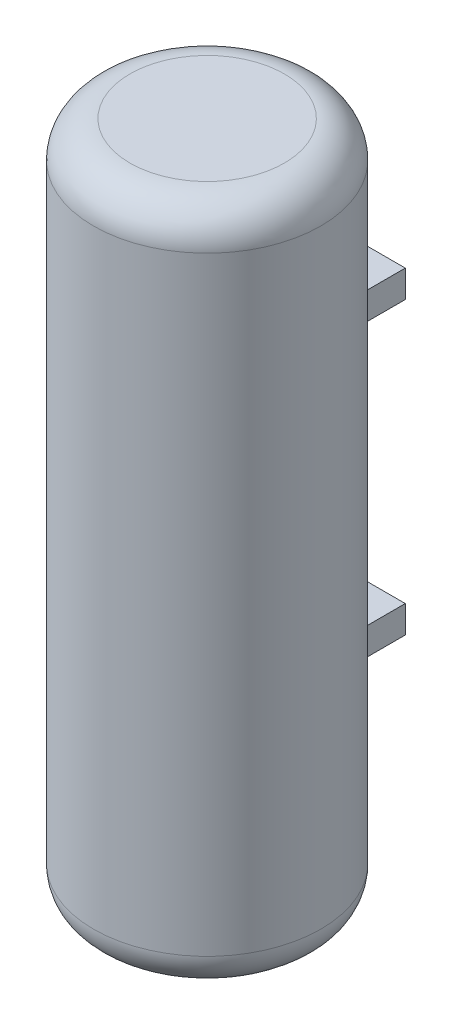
ISO-10303-21;
HEADER;
FILE_DESCRIPTION(('STEP AP214'),'2;1');
FILE_NAME('part.step','',(''),(''),'','','');
FILE_SCHEMA(('AUTOMOTIVE_DESIGN { 1 0 10303 214 1 1 1 1 }'));
ENDSEC;
DATA;
#1=APPLICATION_CONTEXT('core data for automotive mechanical design processes');
#2=APPLICATION_PROTOCOL_DEFINITION('international standard','automotive_design',2000,#1);
#3=PRODUCT_CONTEXT('',#1,'mechanical');
#4=PRODUCT('Part','Part','',(#3));
#5=PRODUCT_RELATED_PRODUCT_CATEGORY('part','',(#4));
#6=PRODUCT_DEFINITION_FORMATION('','',#4);
#7=PRODUCT_DEFINITION_CONTEXT('part definition',#1,'design');
#8=PRODUCT_DEFINITION('design','',#6,#7);
#9=PRODUCT_DEFINITION_SHAPE('','',#8);
#10=(LENGTH_UNIT() NAMED_UNIT(*) SI_UNIT(.MILLI.,.METRE.));
#11=(NAMED_UNIT(*) PLANE_ANGLE_UNIT() SI_UNIT($,.RADIAN.));
#12=(NAMED_UNIT(*) SI_UNIT($,.STERADIAN.) SOLID_ANGLE_UNIT());
#13=UNCERTAINTY_MEASURE_WITH_UNIT(LENGTH_MEASURE(1.E-05),#10,'distance_accuracy_value','');
#14=(GEOMETRIC_REPRESENTATION_CONTEXT(3) GLOBAL_UNCERTAINTY_ASSIGNED_CONTEXT((#13)) GLOBAL_UNIT_ASSIGNED_CONTEXT((#10,
#11,#12)) REPRESENTATION_CONTEXT('',''));
#15=CARTESIAN_POINT('',(0.,0.,0.));
#16=DIRECTION('',(0.,0.,1.));
#17=DIRECTION('',(1.,0.,0.));
#18=AXIS2_PLACEMENT_3D('',#15,#16,#17);
#19=CARTESIAN_POINT('',(0.,1500.,0.));
#20=DIRECTION('',(0.,-1.,0.));
#21=DIRECTION('',(0.,0.,-1.));
#22=AXIS2_PLACEMENT_3D('',#19,#20,#21);
#23=CYLINDRICAL_SURFACE('',#22,250.);
#24=CARTESIAN_POINT('',(0.,507.631468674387,0.));
#25=DIRECTION('',(0.,1.,0.));
#26=DIRECTION('',(0.,0.,1.));
#27=AXIS2_PLACEMENT_3D('',#24,#25,#26);
#28=CIRCLE('',#27,250.);
#29=CARTESIAN_POINT('',(150.,507.631468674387,-200.));
#30=VERTEX_POINT('',#29);
#31=CARTESIAN_POINT('',(-150.,507.631468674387,-200.));
#32=VERTEX_POINT('',#31);
#33=EDGE_CURVE('E41',#30,#32,#28,.T.);
#34=ORIENTED_EDGE('',*,*,#33,.T.);
#35=DIRECTION('',(0.,-1.,0.));
#36=VECTOR('',#35,1.);
#37=CARTESIAN_POINT('',(-150.,1500.,-200.));
#38=LINE('',#37,#36);
#39=CARTESIAN_POINT('',(-150.,447.631468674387,-200.));
#40=VERTEX_POINT('',#39);
#41=EDGE_CURVE('E11',#32,#40,#38,.T.);
#42=ORIENTED_EDGE('',*,*,#41,.T.);
#43=CARTESIAN_POINT('',(0.,447.631468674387,0.));
#44=DIRECTION('',(0.,-1.,0.));
#45=DIRECTION('',(0.,0.,-1.));
#46=AXIS2_PLACEMENT_3D('',#43,#44,#45);
#47=CIRCLE('',#46,250.);
#48=CARTESIAN_POINT('',(150.,447.631468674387,-200.));
#49=VERTEX_POINT('',#48);
#50=EDGE_CURVE('E101',#40,#49,#47,.T.);
#51=ORIENTED_EDGE('',*,*,#50,.T.);
#52=DIRECTION('',(0.,-1.,0.));
#53=VECTOR('',#52,1.);
#54=CARTESIAN_POINT('',(149.999999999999,1500.,-200.));
#55=LINE('',#54,#53);
#56=EDGE_CURVE('E183',#49,#30,#55,.F.);
#57=ORIENTED_EDGE('',*,*,#56,.T.);
#58=EDGE_LOOP('',(#34,#42,#51,#57));
#59=FACE_BOUND('',#58,.T.);
#60=CARTESIAN_POINT('',(0.,1146.93707662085,0.));
#61=DIRECTION('',(0.,1.,0.));
#62=DIRECTION('',(0.,0.,1.));
#63=AXIS2_PLACEMENT_3D('',#60,#61,#62);
#64=CIRCLE('',#63,250.);
#65=CARTESIAN_POINT('',(150.,1146.93707662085,-200.));
#66=VERTEX_POINT('',#65);
#67=CARTESIAN_POINT('',(-150.,1146.93707662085,-200.));
#68=VERTEX_POINT('',#67);
#69=EDGE_CURVE('E176',#66,#68,#64,.T.);
#70=ORIENTED_EDGE('',*,*,#69,.T.);
#71=DIRECTION('',(0.,-1.,0.));
#72=VECTOR('',#71,1.);
#73=CARTESIAN_POINT('',(-150.,1500.,-200.));
#74=LINE('',#73,#72);
#75=CARTESIAN_POINT('',(-150.,1086.93707662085,-200.));
#76=VERTEX_POINT('',#75);
#77=EDGE_CURVE('E179',#68,#76,#74,.T.);
#78=ORIENTED_EDGE('',*,*,#77,.T.);
#79=CARTESIAN_POINT('',(0.,1086.93707662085,0.));
#80=DIRECTION('',(0.,-1.,0.));
#81=DIRECTION('',(0.,0.,-1.));
#82=AXIS2_PLACEMENT_3D('',#79,#80,#81);
#83=CIRCLE('',#82,250.);
#84=CARTESIAN_POINT('',(150.,1086.93707662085,-200.));
#85=VERTEX_POINT('',#84);
#86=EDGE_CURVE('E170',#76,#85,#83,.T.);
#87=ORIENTED_EDGE('',*,*,#86,.T.);
#88=DIRECTION('',(0.,-1.,0.));
#89=VECTOR('',#88,1.);
#90=CARTESIAN_POINT('',(150.,1500.,-200.));
#91=LINE('',#90,#89);
#92=EDGE_CURVE('E173',#85,#66,#91,.F.);
#93=ORIENTED_EDGE('',*,*,#92,.T.);
#94=EDGE_LOOP('',(#70,#78,#87,#93));
#95=FACE_BOUND('',#94,.T.);
#96=CARTESIAN_POINT('',(0.,80.0000000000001,0.));
#97=DIRECTION('',(0.,1.,0.));
#98=DIRECTION('',(0.,0.,1.));
#99=AXIS2_PLACEMENT_3D('',#96,#97,#98);
#100=CIRCLE('',#99,250.);
#101=CARTESIAN_POINT('',(0.,80.0000000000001,250.));
#102=VERTEX_POINT('',#101);
#103=EDGE_CURVE('E152',#102,#102,#100,.T.);
#104=ORIENTED_EDGE('',*,*,#103,.T.);
#105=EDGE_LOOP('',(#104));
#106=FACE_BOUND('',#105,.T.);
#107=CARTESIAN_POINT('',(0.,1420.,0.));
#108=DIRECTION('',(0.,1.,0.));
#109=DIRECTION('',(0.,0.,1.));
#110=AXIS2_PLACEMENT_3D('',#107,#108,#109);
#111=CIRCLE('',#110,250.);
#112=CARTESIAN_POINT('',(0.,1420.,250.));
#113=VERTEX_POINT('',#112);
#114=EDGE_CURVE('E143',#113,#113,#111,.F.);
#115=ORIENTED_EDGE('',*,*,#114,.T.);
#116=EDGE_LOOP('',(#115));
#117=FACE_BOUND('',#116,.T.);
#118=ADVANCED_FACE('F33',(#59,#95,#106,#117),#23,.T.);
#119=CARTESIAN_POINT('',(0.,1500.,0.));
#120=DIRECTION('',(0.,1.,0.));
#121=DIRECTION('',(0.,0.,1.));
#122=AXIS2_PLACEMENT_3D('',#119,#120,#121);
#123=PLANE('',#122);
#124=CARTESIAN_POINT('',(0.,1500.,0.));
#125=DIRECTION('',(0.,1.,0.));
#126=DIRECTION('',(0.,0.,1.));
#127=AXIS2_PLACEMENT_3D('',#124,#125,#126);
#128=CIRCLE('',#127,170.);
#129=CARTESIAN_POINT('',(0.,1500.,170.));
#130=VERTEX_POINT('',#129);
#131=EDGE_CURVE('E158',#130,#130,#128,.T.);
#132=ORIENTED_EDGE('',*,*,#131,.T.);
#133=EDGE_LOOP('',(#132));
#134=FACE_BOUND('',#133,.T.);
#135=ADVANCED_FACE('F203',(#134),#123,.T.);
#136=CARTESIAN_POINT('',(0.,0.,0.));
#137=DIRECTION('',(0.,1.,0.));
#138=DIRECTION('',(0.,0.,1.));
#139=AXIS2_PLACEMENT_3D('',#136,#137,#138);
#140=PLANE('',#139);
#141=CARTESIAN_POINT('',(0.,0.,0.));
#142=DIRECTION('',(0.,1.,0.));
#143=DIRECTION('',(0.,0.,1.));
#144=AXIS2_PLACEMENT_3D('',#141,#142,#143);
#145=CIRCLE('',#144,75.);
#146=CARTESIAN_POINT('',(0.,0.,75.));
#147=VERTEX_POINT('',#146);
#148=EDGE_CURVE('E161',#147,#147,#145,.F.);
#149=ORIENTED_EDGE('',*,*,#148,.F.);
#150=EDGE_LOOP('',(#149));
#151=FACE_BOUND('',#150,.T.);
#152=CARTESIAN_POINT('',(0.,0.,0.));
#153=DIRECTION('',(0.,1.,0.));
#154=DIRECTION('',(0.,0.,1.));
#155=AXIS2_PLACEMENT_3D('',#152,#153,#154);
#156=CIRCLE('',#155,170.);
#157=CARTESIAN_POINT('',(0.,0.,170.));
#158=VERTEX_POINT('',#157);
#159=EDGE_CURVE('E155',#158,#158,#156,.F.);
#160=ORIENTED_EDGE('',*,*,#159,.T.);
#161=EDGE_LOOP('',(#160));
#162=FACE_BOUND('',#161,.T.);
#163=ADVANCED_FACE('F208',(#151,#162),#140,.F.);
#164=CARTESIAN_POINT('',(0.,80.0000000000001,0.));
#165=DIRECTION('',(0.,1.,0.));
#166=DIRECTION('',(0.,0.,1.));
#167=AXIS2_PLACEMENT_3D('',#164,#165,#166);
#168=TOROIDAL_SURFACE('',#167,170.,80.);
#169=ORIENTED_EDGE('',*,*,#159,.F.);
#170=EDGE_LOOP('',(#169));
#171=FACE_BOUND('',#170,.T.);
#172=ORIENTED_EDGE('',*,*,#103,.F.);
#173=EDGE_LOOP('',(#172));
#174=FACE_BOUND('',#173,.T.);
#175=ADVANCED_FACE('F213',(#171,#174),#168,.T.);
#176=CARTESIAN_POINT('',(0.,1420.,0.));
#177=DIRECTION('',(0.,1.,0.));
#178=DIRECTION('',(0.,0.,1.));
#179=AXIS2_PLACEMENT_3D('',#176,#177,#178);
#180=TOROIDAL_SURFACE('',#179,170.,80.);
#181=ORIENTED_EDGE('',*,*,#114,.F.);
#182=EDGE_LOOP('',(#181));
#183=FACE_BOUND('',#182,.T.);
#184=ORIENTED_EDGE('',*,*,#131,.F.);
#185=EDGE_LOOP('',(#184));
#186=FACE_BOUND('',#185,.T.);
#187=ADVANCED_FACE('F215',(#183,#186),#180,.T.);
#188=CARTESIAN_POINT('',(0.,-60.,0.));
#189=DIRECTION('',(0.,1.,0.));
#190=DIRECTION('',(0.,0.,1.));
#191=AXIS2_PLACEMENT_3D('',#188,#189,#190);
#192=CYLINDRICAL_SURFACE('',#191,75.);
#193=CARTESIAN_POINT('',(0.,-40.0000000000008,0.));
#194=DIRECTION('',(0.,-1.,0.));
#195=DIRECTION('',(0.,0.,-1.));
#196=AXIS2_PLACEMENT_3D('',#193,#194,#195);
#197=CIRCLE('',#196,75.);
#198=CARTESIAN_POINT('',(0.,-40.0000000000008,75.));
#199=VERTEX_POINT('',#198);
#200=EDGE_CURVE('E167',#199,#199,#197,.F.);
#201=CARTESIAN_POINT('',(0.,-40.0000000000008,75.));
#202=CARTESIAN_POINT('',(0.,-39.5833333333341,75.));
#203=CARTESIAN_POINT('',(0.,-39.1666666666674,75.));
#204=CARTESIAN_POINT('',(0.,-38.3333333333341,75.));
#205=CARTESIAN_POINT('',(0.,-37.9166666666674,75.));
#206=CARTESIAN_POINT('',(0.,-37.0833333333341,75.));
#207=CARTESIAN_POINT('',(0.,-36.6666666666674,75.));
#208=CARTESIAN_POINT('',(0.,-35.833333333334,75.));
#209=CARTESIAN_POINT('',(0.,-35.4166666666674,75.));
#210=CARTESIAN_POINT('',(0.,-34.583333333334,75.));
#211=CARTESIAN_POINT('',(0.,-34.1666666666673,75.));
#212=CARTESIAN_POINT('',(0.,-33.333333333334,75.));
#213=CARTESIAN_POINT('',(0.,-32.9166666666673,75.));
#214=CARTESIAN_POINT('',(0.,-32.0833333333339,75.));
#215=CARTESIAN_POINT('',(0.,-31.6666666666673,75.));
#216=CARTESIAN_POINT('',(0.,-30.8333333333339,75.));
#217=CARTESIAN_POINT('',(0.,-30.4166666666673,75.));
#218=CARTESIAN_POINT('',(0.,-29.5833333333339,75.));
#219=CARTESIAN_POINT('',(0.,-29.1666666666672,75.));
#220=CARTESIAN_POINT('',(0.,-28.3333333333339,75.));
#221=CARTESIAN_POINT('',(0.,-27.9166666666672,75.));
#222=CARTESIAN_POINT('',(0.,-27.0833333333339,75.));
#223=CARTESIAN_POINT('',(0.,-26.6666666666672,75.));
#224=CARTESIAN_POINT('',(0.,-25.8333333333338,75.));
#225=CARTESIAN_POINT('',(0.,-25.4166666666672,75.));
#226=CARTESIAN_POINT('',(0.,-24.5833333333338,75.));
#227=CARTESIAN_POINT('',(0.,-24.1666666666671,75.));
#228=CARTESIAN_POINT('',(0.,-23.3333333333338,75.));
#229=CARTESIAN_POINT('',(0.,-22.9166666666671,75.));
#230=CARTESIAN_POINT('',(0.,-22.0833333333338,75.));
#231=CARTESIAN_POINT('',(0.,-21.6666666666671,75.));
#232=CARTESIAN_POINT('',(0.,-20.8333333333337,75.));
#233=CARTESIAN_POINT('',(0.,-20.4166666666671,75.));
#234=CARTESIAN_POINT('',(0.,-19.5833333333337,75.));
#235=CARTESIAN_POINT('',(0.,-19.166666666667,75.));
#236=CARTESIAN_POINT('',(0.,-18.3333333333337,75.));
#237=CARTESIAN_POINT('',(0.,-17.916666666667,75.));
#238=CARTESIAN_POINT('',(0.,-17.0833333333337,75.));
#239=CARTESIAN_POINT('',(0.,-16.666666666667,75.));
#240=CARTESIAN_POINT('',(0.,-15.8333333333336,75.));
#241=CARTESIAN_POINT('',(0.,-15.416666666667,75.));
#242=CARTESIAN_POINT('',(0.,-14.5833333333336,75.));
#243=CARTESIAN_POINT('',(0.,-14.1666666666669,75.));
#244=CARTESIAN_POINT('',(0.,-13.3333333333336,75.));
#245=CARTESIAN_POINT('',(0.,-12.9166666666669,75.));
#246=CARTESIAN_POINT('',(0.,-12.0833333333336,75.));
#247=CARTESIAN_POINT('',(0.,-11.6666666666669,75.));
#248=CARTESIAN_POINT('',(0.,-10.8333333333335,75.));
#249=CARTESIAN_POINT('',(0.,-10.4166666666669,75.));
#250=CARTESIAN_POINT('',(0.,-9.58333333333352,75.));
#251=CARTESIAN_POINT('',(0.,-9.16666666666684,75.));
#252=CARTESIAN_POINT('',(0.,-8.33333333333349,75.));
#253=CARTESIAN_POINT('',(0.,-7.91666666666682,75.));
#254=CARTESIAN_POINT('',(0.,-7.08333333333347,75.));
#255=CARTESIAN_POINT('',(0.,-6.6666666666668,75.));
#256=CARTESIAN_POINT('',(0.,-5.83333333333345,75.));
#257=CARTESIAN_POINT('',(0.,-5.41666666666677,75.));
#258=CARTESIAN_POINT('',(0.,-4.58333333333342,75.));
#259=CARTESIAN_POINT('',(0.,-4.16666666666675,75.));
#260=CARTESIAN_POINT('',(0.,-3.3333333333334,75.));
#261=CARTESIAN_POINT('',(0.,-2.91666666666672,75.));
#262=CARTESIAN_POINT('',(0.,-2.08333333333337,75.));
#263=CARTESIAN_POINT('',(0.,-1.6666666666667,75.));
#264=CARTESIAN_POINT('',(0.,-0.833333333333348,75.));
#265=CARTESIAN_POINT('',(0.,-0.416666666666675,75.));
#266=CARTESIAN_POINT('',(0.,0.,75.));
#267=B_SPLINE_CURVE_WITH_KNOTS('',3,(#201,#202,#203,#204,#205,#206,#207,#208,#209,#210,#211,
#212,#213,#214,#215,#216,#217,#218,#219,#220,#221,#222,#223,#224,#225,#226,#227,#228,#229,#230,
#231,#232,#233,#234,#235,#236,#237,#238,#239,#240,#241,#242,#243,#244,#245,#246,#247,#248,#249,
#250,#251,#252,#253,#254,#255,#256,#257,#258,#259,#260,#261,#262,#263,#264,#265,#266),
.UNSPECIFIED.,.F.,.F.,(4,2,2,2,2,2,2,2,2,2,2,2,2,2,2,2,2,2,2,2,2,2,2,2,2,2,2,2,2,2,2,2,4),(0.,
1.25000000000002,2.50000000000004,3.75000000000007,5.0000000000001,6.25000000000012,
7.50000000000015,8.75000000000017,10.0000000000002,11.2500000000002,12.5000000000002,
13.7500000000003,15.0000000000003,16.2500000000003,17.5000000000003,18.7500000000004,
20.0000000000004,21.2500000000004,22.5000000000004,23.7500000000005,25.0000000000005,
26.2500000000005,27.5000000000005,28.7500000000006,30.0000000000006,31.2500000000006,
32.5000000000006,33.7500000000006,35.0000000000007,36.2500000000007,37.5000000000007,
38.7500000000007,40.0000000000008),.UNSPECIFIED.);
#268=EDGE_CURVE('BSEAM218',#199,#147,#267,.T.);
#269=ORIENTED_EDGE('',*,*,#200,.T.);
#270=ORIENTED_EDGE('',*,*,#148,.T.);
#271=ORIENTED_EDGE('',*,*,#268,.T.);
#272=ORIENTED_EDGE('',*,*,#268,.F.);
#273=EDGE_LOOP('',(#269,#271,#270,#272));
#274=FACE_BOUND('',#273,.T.);
#275=ADVANCED_FACE('F218',(#274),#192,.T.);
#276=CARTESIAN_POINT('',(0.,-60.,0.));
#277=DIRECTION('',(0.,-1.,0.));
#278=DIRECTION('',(0.,0.,-1.));
#279=AXIS2_PLACEMENT_3D('',#276,#277,#278);
#280=PLANE('',#279);
#281=CARTESIAN_POINT('',(0.,-60.,0.));
#282=DIRECTION('',(0.,-1.,0.));
#283=DIRECTION('',(0.,0.,-1.));
#284=AXIS2_PLACEMENT_3D('',#281,#282,#283);
#285=CIRCLE('',#284,55.0000000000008);
#286=CARTESIAN_POINT('',(0.,-60.,-55.0000000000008));
#287=VERTEX_POINT('',#286);
#288=EDGE_CURVE('E164',#287,#287,#285,.T.);
#289=ORIENTED_EDGE('',*,*,#288,.T.);
#290=EDGE_LOOP('',(#289));
#291=FACE_BOUND('',#290,.T.);
#292=ADVANCED_FACE('F223',(#291),#280,.T.);
#293=CARTESIAN_POINT('',(0.,-60.,0.));
#294=DIRECTION('',(0.,1.,0.));
#295=DIRECTION('',(0.,0.,1.));
#296=AXIS2_PLACEMENT_3D('',#293,#294,#295);
#297=CONICAL_SURFACE('',#296,55.0000000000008,0.785398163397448);
#298=ORIENTED_EDGE('',*,*,#200,.F.);
#299=EDGE_LOOP('',(#298));
#300=FACE_BOUND('',#299,.T.);
#301=ORIENTED_EDGE('',*,*,#288,.F.);
#302=EDGE_LOOP('',(#301));
#303=FACE_BOUND('',#302,.T.);
#304=ADVANCED_FACE('F35',(#300,#303),#297,.T.);
#305=CARTESIAN_POINT('',(-150.,1146.93707662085,-286.));
#306=DIRECTION('',(-1.,0.,0.));
#307=DIRECTION('',(0.,0.,1.));
#308=AXIS2_PLACEMENT_3D('',#305,#306,#307);
#309=PLANE('',#308);
#310=ORIENTED_EDGE('',*,*,#77,.F.);
#311=DIRECTION('',(0.,0.,1.));
#312=VECTOR('',#311,1.);
#313=CARTESIAN_POINT('',(-150.,1146.93707662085,-286.));
#314=LINE('',#313,#312);
#315=CARTESIAN_POINT('',(-150.,1146.93707662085,-286.));
#316=VERTEX_POINT('',#315);
#317=EDGE_CURVE('E140',#316,#68,#314,.T.);
#318=ORIENTED_EDGE('',*,*,#317,.F.);
#319=DIRECTION('',(0.,-1.,0.));
#320=VECTOR('',#319,1.);
#321=CARTESIAN_POINT('',(-150.,1146.93707662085,-286.));
#322=LINE('',#321,#320);
#323=CARTESIAN_POINT('',(-150.,1086.93707662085,-286.));
#324=VERTEX_POINT('',#323);
#325=EDGE_CURVE('E124',#316,#324,#322,.T.);
#326=ORIENTED_EDGE('',*,*,#325,.T.);
#327=DIRECTION('',(0.,0.,1.));
#328=VECTOR('',#327,1.);
#329=CARTESIAN_POINT('',(-150.,1086.93707662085,-286.));
#330=LINE('',#329,#328);
#331=EDGE_CURVE('E139',#324,#76,#330,.T.);
#332=ORIENTED_EDGE('',*,*,#331,.T.);
#333=EDGE_LOOP('',(#310,#318,#326,#332));
#334=FACE_BOUND('',#333,.T.);
#335=ADVANCED_FACE('F237',(#334),#309,.T.);
#336=CARTESIAN_POINT('',(150.,1146.93707662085,-286.));
#337=DIRECTION('',(1.,0.,0.));
#338=DIRECTION('',(0.,1.,0.));
#339=AXIS2_PLACEMENT_3D('',#336,#337,#338);
#340=PLANE('',#339);
#341=ORIENTED_EDGE('',*,*,#92,.F.);
#342=DIRECTION('',(0.,0.,1.));
#343=VECTOR('',#342,1.);
#344=CARTESIAN_POINT('',(150.,1086.93707662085,-286.));
#345=LINE('',#344,#343);
#346=CARTESIAN_POINT('',(150.,1086.93707662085,-286.));
#347=VERTEX_POINT('',#346);
#348=EDGE_CURVE('E56',#347,#85,#345,.T.);
#349=ORIENTED_EDGE('',*,*,#348,.F.);
#350=DIRECTION('',(0.,1.,0.));
#351=VECTOR('',#350,1.);
#352=CARTESIAN_POINT('',(150.,1146.93707662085,-286.));
#353=LINE('',#352,#351);
#354=CARTESIAN_POINT('',(150.,1146.93707662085,-286.));
#355=VERTEX_POINT('',#354);
#356=EDGE_CURVE('E133',#347,#355,#353,.T.);
#357=ORIENTED_EDGE('',*,*,#356,.T.);
#358=DIRECTION('',(0.,0.,1.));
#359=VECTOR('',#358,1.);
#360=CARTESIAN_POINT('',(150.,1146.93707662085,-286.));
#361=LINE('',#360,#359);
#362=EDGE_CURVE('E144',#355,#66,#361,.T.);
#363=ORIENTED_EDGE('',*,*,#362,.T.);
#364=EDGE_LOOP('',(#341,#349,#357,#363));
#365=FACE_BOUND('',#364,.T.);
#366=ADVANCED_FACE('F240',(#365),#340,.T.);
#367=CARTESIAN_POINT('',(-150.,1146.93707662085,-286.));
#368=DIRECTION('',(0.,1.,0.));
#369=DIRECTION('',(0.,0.,1.));
#370=AXIS2_PLACEMENT_3D('',#367,#368,#369);
#371=PLANE('',#370);
#372=ORIENTED_EDGE('',*,*,#69,.F.);
#373=ORIENTED_EDGE('',*,*,#362,.F.);
#374=DIRECTION('',(-1.,0.,0.));
#375=VECTOR('',#374,1.);
#376=CARTESIAN_POINT('',(-150.,1146.93707662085,-286.));
#377=LINE('',#376,#375);
#378=EDGE_CURVE('E136',#355,#316,#377,.T.);
#379=ORIENTED_EDGE('',*,*,#378,.T.);
#380=ORIENTED_EDGE('',*,*,#317,.T.);
#381=EDGE_LOOP('',(#372,#373,#379,#380));
#382=FACE_BOUND('',#381,.T.);
#383=ADVANCED_FACE('F245',(#382),#371,.T.);
#384=CARTESIAN_POINT('',(-150.,1086.93707662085,-286.));
#385=DIRECTION('',(0.,-1.,0.));
#386=DIRECTION('',(0.,0.,-1.));
#387=AXIS2_PLACEMENT_3D('',#384,#385,#386);
#388=PLANE('',#387);
#389=ORIENTED_EDGE('',*,*,#86,.F.);
#390=ORIENTED_EDGE('',*,*,#331,.F.);
#391=DIRECTION('',(1.,0.,0.));
#392=VECTOR('',#391,1.);
#393=CARTESIAN_POINT('',(-150.,1086.93707662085,-286.));
#394=LINE('',#393,#392);
#395=EDGE_CURVE('E131',#324,#347,#394,.T.);
#396=ORIENTED_EDGE('',*,*,#395,.T.);
#397=ORIENTED_EDGE('',*,*,#348,.T.);
#398=EDGE_LOOP('',(#389,#390,#396,#397));
#399=FACE_BOUND('',#398,.T.);
#400=ADVANCED_FACE('F242',(#399),#388,.T.);
#401=CARTESIAN_POINT('',(0.,0.,-286.));
#402=DIRECTION('',(0.,0.,1.));
#403=DIRECTION('',(1.,0.,0.));
#404=AXIS2_PLACEMENT_3D('',#401,#402,#403);
#405=PLANE('',#404);
#406=ORIENTED_EDGE('',*,*,#325,.F.);
#407=ORIENTED_EDGE('',*,*,#378,.F.);
#408=ORIENTED_EDGE('',*,*,#356,.F.);
#409=ORIENTED_EDGE('',*,*,#395,.F.);
#410=EDGE_LOOP('',(#406,#407,#408,#409));
#411=FACE_BOUND('',#410,.T.);
#412=ADVANCED_FACE('F199',(#411),#405,.F.);
#413=CARTESIAN_POINT('',(-150.,507.631468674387,-286.));
#414=DIRECTION('',(-1.,0.,0.));
#415=DIRECTION('',(0.,0.,1.));
#416=AXIS2_PLACEMENT_3D('',#413,#414,#415);
#417=PLANE('',#416);
#418=ORIENTED_EDGE('',*,*,#41,.F.);
#419=DIRECTION('',(0.,0.,1.));
#420=VECTOR('',#419,1.);
#421=CARTESIAN_POINT('',(-150.,507.631468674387,-286.));
#422=LINE('',#421,#420);
#423=CARTESIAN_POINT('',(-150.,507.631468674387,-286.));
#424=VERTEX_POINT('',#423);
#425=EDGE_CURVE('E118',#424,#32,#422,.T.);
#426=ORIENTED_EDGE('',*,*,#425,.F.);
#427=DIRECTION('',(0.,-1.,0.));
#428=VECTOR('',#427,1.);
#429=CARTESIAN_POINT('',(-150.,507.631468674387,-286.));
#430=LINE('',#429,#428);
#431=CARTESIAN_POINT('',(-150.,447.631468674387,-286.));
#432=VERTEX_POINT('',#431);
#433=EDGE_CURVE('E111',#424,#432,#430,.T.);
#434=ORIENTED_EDGE('',*,*,#433,.T.);
#435=DIRECTION('',(0.,0.,1.));
#436=VECTOR('',#435,1.);
#437=CARTESIAN_POINT('',(-150.,447.631468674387,-286.));
#438=LINE('',#437,#436);
#439=EDGE_CURVE('E96',#432,#40,#438,.T.);
#440=ORIENTED_EDGE('',*,*,#439,.T.);
#441=EDGE_LOOP('',(#418,#426,#434,#440));
#442=FACE_BOUND('',#441,.T.);
#443=ADVANCED_FACE('F116',(#442),#417,.T.);
#444=CARTESIAN_POINT('',(150.,507.631468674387,-286.));
#445=DIRECTION('',(1.,0.,0.));
#446=DIRECTION('',(0.,1.,0.));
#447=AXIS2_PLACEMENT_3D('',#444,#445,#446);
#448=PLANE('',#447);
#449=ORIENTED_EDGE('',*,*,#56,.F.);
#450=DIRECTION('',(0.,0.,1.));
#451=VECTOR('',#450,1.);
#452=CARTESIAN_POINT('',(150.,447.631468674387,-286.));
#453=LINE('',#452,#451);
#454=CARTESIAN_POINT('',(150.,447.631468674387,-286.));
#455=VERTEX_POINT('',#454);
#456=EDGE_CURVE('E48',#455,#49,#453,.T.);
#457=ORIENTED_EDGE('',*,*,#456,.F.);
#458=DIRECTION('',(0.,1.,0.));
#459=VECTOR('',#458,1.);
#460=CARTESIAN_POINT('',(150.,507.631468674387,-286.));
#461=LINE('',#460,#459);
#462=CARTESIAN_POINT('',(150.,507.631468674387,-286.));
#463=VERTEX_POINT('',#462);
#464=EDGE_CURVE('E114',#455,#463,#461,.T.);
#465=ORIENTED_EDGE('',*,*,#464,.T.);
#466=DIRECTION('',(0.,0.,1.));
#467=VECTOR('',#466,1.);
#468=CARTESIAN_POINT('',(150.,507.631468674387,-286.));
#469=LINE('',#468,#467);
#470=EDGE_CURVE('E125',#463,#30,#469,.T.);
#471=ORIENTED_EDGE('',*,*,#470,.T.);
#472=EDGE_LOOP('',(#449,#457,#465,#471));
#473=FACE_BOUND('',#472,.T.);
#474=ADVANCED_FACE('F191',(#473),#448,.T.);
#475=CARTESIAN_POINT('',(-150.,507.631468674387,-286.));
#476=DIRECTION('',(0.,1.,0.));
#477=DIRECTION('',(0.,0.,1.));
#478=AXIS2_PLACEMENT_3D('',#475,#476,#477);
#479=PLANE('',#478);
#480=ORIENTED_EDGE('',*,*,#33,.F.);
#481=ORIENTED_EDGE('',*,*,#470,.F.);
#482=DIRECTION('',(-1.,0.,0.));
#483=VECTOR('',#482,1.);
#484=CARTESIAN_POINT('',(-150.,507.631468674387,-286.));
#485=LINE('',#484,#483);
#486=EDGE_CURVE('E104',#463,#424,#485,.T.);
#487=ORIENTED_EDGE('',*,*,#486,.T.);
#488=ORIENTED_EDGE('',*,*,#425,.T.);
#489=EDGE_LOOP('',(#480,#481,#487,#488));
#490=FACE_BOUND('',#489,.T.);
#491=ADVANCED_FACE('F189',(#490),#479,.T.);
#492=CARTESIAN_POINT('',(-150.,447.631468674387,-286.));
#493=DIRECTION('',(0.,-1.,0.));
#494=DIRECTION('',(0.,0.,-1.));
#495=AXIS2_PLACEMENT_3D('',#492,#493,#494);
#496=PLANE('',#495);
#497=ORIENTED_EDGE('',*,*,#50,.F.);
#498=ORIENTED_EDGE('',*,*,#439,.F.);
#499=DIRECTION('',(1.,0.,0.));
#500=VECTOR('',#499,1.);
#501=CARTESIAN_POINT('',(-150.,447.631468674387,-286.));
#502=LINE('',#501,#500);
#503=EDGE_CURVE('E99',#432,#455,#502,.T.);
#504=ORIENTED_EDGE('',*,*,#503,.T.);
#505=ORIENTED_EDGE('',*,*,#456,.T.);
#506=EDGE_LOOP('',(#497,#498,#504,#505));
#507=FACE_BOUND('',#506,.T.);
#508=ADVANCED_FACE('F98',(#507),#496,.T.);
#509=CARTESIAN_POINT('',(0.,0.,-286.));
#510=DIRECTION('',(0.,0.,1.));
#511=DIRECTION('',(1.,0.,0.));
#512=AXIS2_PLACEMENT_3D('',#509,#510,#511);
#513=PLANE('',#512);
#514=ORIENTED_EDGE('',*,*,#433,.F.);
#515=ORIENTED_EDGE('',*,*,#486,.F.);
#516=ORIENTED_EDGE('',*,*,#464,.F.);
#517=ORIENTED_EDGE('',*,*,#503,.F.);
#518=EDGE_LOOP('',(#514,#515,#516,#517));
#519=FACE_BOUND('',#518,.T.);
#520=ADVANCED_FACE('F109',(#519),#513,.F.);
#521=CLOSED_SHELL('',(#118,#135,#163,#175,#187,#275,#292,#304,#335,#366,#383,#400,#412,#443,
#474,#491,#508,#520));
#522=MANIFOLD_SOLID_BREP('B2',#521);
#523=ADVANCED_BREP_SHAPE_REPRESENTATION('',(#18,#522),#14);
#524=SHAPE_DEFINITION_REPRESENTATION(#9,#523);
ENDSEC;
END-ISO-10303-21;
